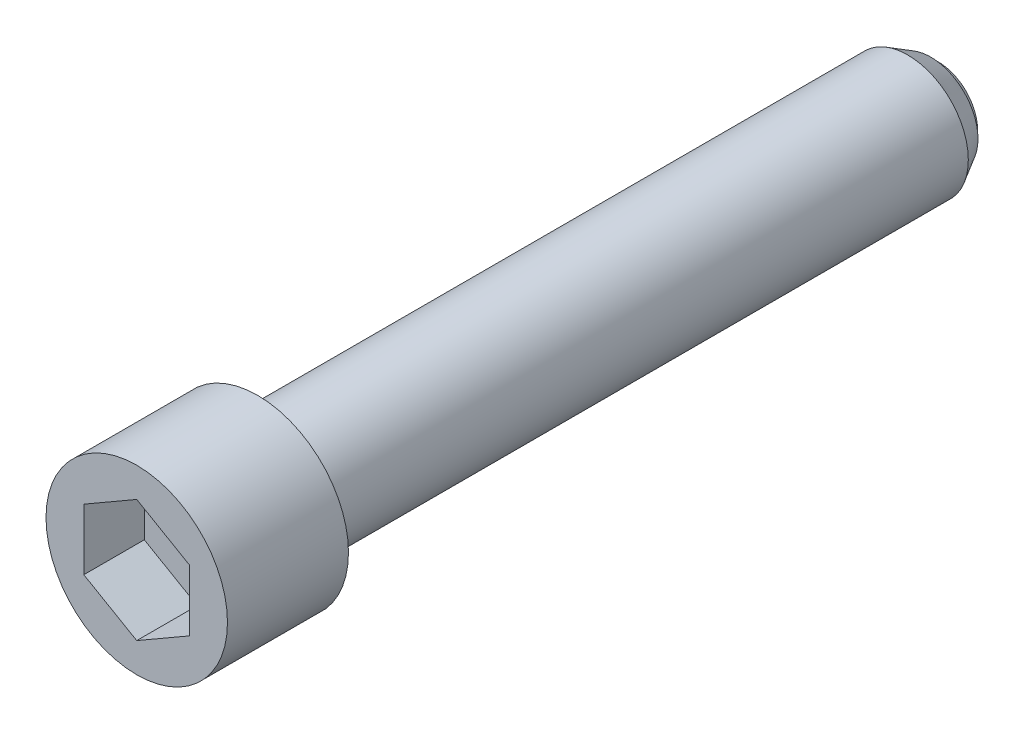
ISO-10303-21;
HEADER;
FILE_DESCRIPTION(('STEP AP214'),'2;1');
FILE_NAME('part.step','',(''),(''),'','','');
FILE_SCHEMA(('AUTOMOTIVE_DESIGN { 1 0 10303 214 1 1 1 1 }'));
ENDSEC;
DATA;
#1=APPLICATION_CONTEXT('core data for automotive mechanical design processes');
#2=APPLICATION_PROTOCOL_DEFINITION('international standard','automotive_design',2000,#1);
#3=PRODUCT_CONTEXT('',#1,'mechanical');
#4=PRODUCT('Part','Part','',(#3));
#5=PRODUCT_RELATED_PRODUCT_CATEGORY('part','',(#4));
#6=PRODUCT_DEFINITION_FORMATION('','',#4);
#7=PRODUCT_DEFINITION_CONTEXT('part definition',#1,'design');
#8=PRODUCT_DEFINITION('design','',#6,#7);
#9=PRODUCT_DEFINITION_SHAPE('','',#8);
#10=(LENGTH_UNIT() NAMED_UNIT(*) SI_UNIT(.MILLI.,.METRE.));
#11=(NAMED_UNIT(*) PLANE_ANGLE_UNIT() SI_UNIT($,.RADIAN.));
#12=(NAMED_UNIT(*) SI_UNIT($,.STERADIAN.) SOLID_ANGLE_UNIT());
#13=UNCERTAINTY_MEASURE_WITH_UNIT(LENGTH_MEASURE(1.E-05),#10,'distance_accuracy_value','');
#14=(GEOMETRIC_REPRESENTATION_CONTEXT(3) GLOBAL_UNCERTAINTY_ASSIGNED_CONTEXT((#13)) GLOBAL_UNIT_ASSIGNED_CONTEXT((#10,
#11,#12)) REPRESENTATION_CONTEXT('',''));
#15=CARTESIAN_POINT('',(0.,0.,0.));
#16=DIRECTION('',(0.,0.,1.));
#17=DIRECTION('',(1.,0.,0.));
#18=AXIS2_PLACEMENT_3D('',#15,#16,#17);
#19=CARTESIAN_POINT('',(0.,0.,3.));
#20=DIRECTION('',(0.,0.,-1.));
#21=DIRECTION('',(1.,0.,0.));
#22=AXIS2_PLACEMENT_3D('',#19,#20,#21);
#23=SPHERICAL_SURFACE('',#22,6.);
#24=CARTESIAN_POINT('',(0.,0.,1.));
#25=DIRECTION('',(0.,0.,-1.));
#26=DIRECTION('',(1.,0.,0.));
#27=AXIS2_PLACEMENT_3D('',#24,#25,#26);
#28=CIRCLE('',#27,5.65685424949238);
#29=CARTESIAN_POINT('',(5.65685424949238,0.,1.));
#30=VERTEX_POINT('',#29);
#31=EDGE_CURVE('E9',#30,#30,#28,.T.);
#32=CARTESIAN_POINT('',(0.,0.,0.));
#33=DIRECTION('',(0.,0.,-1.));
#34=DIRECTION('',(1.,0.,0.));
#35=AXIS2_PLACEMENT_3D('',#32,#33,#34);
#36=CIRCLE('',#35,5.19615242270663);
#37=CARTESIAN_POINT('',(5.19615242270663,0.,0.));
#38=VERTEX_POINT('',#37);
#39=EDGE_CURVE('E17',#38,#38,#36,.F.);
#40=CARTESIAN_POINT('',(5.65685424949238,0.,1.));
#41=CARTESIAN_POINT('',(5.65302587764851,0.,0.989171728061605));
#42=CARTESIAN_POINT('',(5.64916641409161,0.,0.978354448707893));
#43=CARTESIAN_POINT('',(5.64138543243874,0.,0.956742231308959));
#44=CARTESIAN_POINT('',(5.63746391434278,0.,0.945947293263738));
#45=CARTESIAN_POINT('',(5.62955895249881,0.,0.924380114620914));
#46=CARTESIAN_POINT('',(5.62557550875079,0.,0.913607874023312));
#47=CARTESIAN_POINT('',(5.61754682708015,0.,0.892086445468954));
#48=CARTESIAN_POINT('',(5.61350158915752,0.,0.881337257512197));
#49=CARTESIAN_POINT('',(5.60534945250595,0.,0.859862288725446));
#50=CARTESIAN_POINT('',(5.60124255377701,0.,0.849136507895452));
#51=CARTESIAN_POINT('',(5.59296723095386,0.,0.827708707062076));
#52=CARTESIAN_POINT('',(5.58879880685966,0.,0.817006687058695));
#53=CARTESIAN_POINT('',(5.58040057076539,0.,0.795626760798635));
#54=CARTESIAN_POINT('',(5.57617075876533,0.,0.784948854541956));
#55=CARTESIAN_POINT('',(5.56764988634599,0.,0.763617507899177));
#56=CARTESIAN_POINT('',(5.56335882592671,0.,0.752964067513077));
#57=CARTESIAN_POINT('',(5.55471559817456,0.,0.731682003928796));
#58=CARTESIAN_POINT('',(5.55036343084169,0.,0.721053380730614));
#59=CARTESIAN_POINT('',(5.54159813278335,0.,0.699821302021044));
#60=CARTESIAN_POINT('',(5.53718500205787,0.,0.689217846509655));
#61=CARTESIAN_POINT('',(5.52829792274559,0.,0.668036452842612));
#62=CARTESIAN_POINT('',(5.52382397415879,0.,0.657458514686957));
#63=CARTESIAN_POINT('',(5.51481540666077,0.,0.636328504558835));
#64=CARTESIAN_POINT('',(5.51028078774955,0.,0.625776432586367));
#65=CARTESIAN_POINT('',(5.50115102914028,0.,0.604698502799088));
#66=CARTESIAN_POINT('',(5.49655588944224,0.,0.594172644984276));
#67=CARTESIAN_POINT('',(5.48730524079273,0.,0.573147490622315));
#68=CARTESIAN_POINT('',(5.48264973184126,0.,0.562648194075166));
#69=CARTESIAN_POINT('',(5.47327849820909,0.,0.541676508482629));
#70=CARTESIAN_POINT('',(5.46856277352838,0.,0.531204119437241));
#71=CARTESIAN_POINT('',(5.45907126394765,0.,0.510286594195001));
#72=CARTESIAN_POINT('',(5.45429547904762,0.,0.499841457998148));
#73=CARTESIAN_POINT('',(5.44468400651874,0.,0.478978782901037));
#74=CARTESIAN_POINT('',(5.43984831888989,0.,0.468561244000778));
#75=CARTESIAN_POINT('',(5.43011720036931,0.,0.447754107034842));
#76=CARTESIAN_POINT('',(5.42522176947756,0.,0.437364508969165));
#77=CARTESIAN_POINT('',(5.41537132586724,0.,0.416613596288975));
#78=CARTESIAN_POINT('',(5.41041631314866,0.,0.406252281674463));
#79=CARTESIAN_POINT('',(5.40044686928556,0.,0.385558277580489));
#80=CARTESIAN_POINT('',(5.39543243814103,0.,0.375225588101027));
#81=CARTESIAN_POINT('',(5.38534432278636,0.,0.354589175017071));
#82=CARTESIAN_POINT('',(5.3802706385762,0.,0.344285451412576));
#83=CARTESIAN_POINT('',(5.37006418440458,0.,0.323707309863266));
#84=CARTESIAN_POINT('',(5.3649314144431,0.,0.313432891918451));
#85=CARTESIAN_POINT('',(5.35460695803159,0.,0.292913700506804));
#86=CARTESIAN_POINT('',(5.34941527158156,0.,0.282668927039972));
#87=CARTESIAN_POINT('',(5.33897315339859,0.,0.262209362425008));
#88=CARTESIAN_POINT('',(5.33372272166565,0.,0.251994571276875));
#89=CARTESIAN_POINT('',(5.32316328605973,0.,0.231595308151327));
#90=CARTESIAN_POINT('',(5.31785428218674,0.,0.221410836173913));
#91=CARTESIAN_POINT('',(5.30717787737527,0.,0.201072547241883));
#92=CARTESIAN_POINT('',(5.30181047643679,0.,0.190918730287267));
#93=CARTESIAN_POINT('',(5.29101745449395,0.,0.170642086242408));
#94=CARTESIAN_POINT('',(5.28559183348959,0.,0.160519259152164));
#95=CARTESIAN_POINT('',(5.27468255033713,0.,0.140304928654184));
#96=CARTESIAN_POINT('',(5.26919888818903,0.,0.130213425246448));
#97=CARTESIAN_POINT('',(5.25817370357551,0.,0.110062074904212));
#98=CARTESIAN_POINT('',(5.25263218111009,0.,0.100002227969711));
#99=CARTESIAN_POINT('',(5.24149145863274,0.,0.0799145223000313));
#100=CARTESIAN_POINT('',(5.23589225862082,0.,0.0698866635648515));
#101=CARTESIAN_POINT('',(5.22463636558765,0.,0.0498632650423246));
#102=CARTESIAN_POINT('',(5.2189796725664,0.,0.0398677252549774));
#103=CARTESIAN_POINT('',(5.20760898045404,0.,0.019909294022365));
#104=CARTESIAN_POINT('',(5.20189498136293,0.,0.0099464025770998));
#105=CARTESIAN_POINT('',(5.19615242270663,0.,0.));
#106=B_SPLINE_CURVE_WITH_KNOTS('',3,(#40,#41,#42,#43,#44,#45,#46,#47,#48,#49,#50,#51,#52,#53,
#54,#55,#56,#57,#58,#59,#60,#61,#62,#63,#64,#65,#66,#67,#68,#69,#70,#71,#72,#73,#74,#75,#76,#77,
#78,#79,#80,#81,#82,#83,#84,#85,#86,#87,#88,#89,#90,#91,#92,#93,#94,#95,#96,#97,#98,#99,#100,
#101,#102,#103,#104,#105),.UNSPECIFIED.,.F.,.F.,(4,2,2,2,2,2,2,2,2,2,2,2,2,2,2,2,2,2,2,2,2,2,2,
2,2,2,2,2,2,2,2,2,4),(0.,0.0344553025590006,0.0689106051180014,0.103365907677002,
0.137821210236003,0.172276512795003,0.206731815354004,0.241187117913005,0.275642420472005,
0.310097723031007,0.344553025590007,0.379008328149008,0.413463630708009,0.44791893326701,
0.48237423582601,0.516829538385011,0.551284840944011,0.585740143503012,0.620195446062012,
0.654650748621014,0.689106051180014,0.723561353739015,0.758016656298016,0.792471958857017,
0.826927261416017,0.861382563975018,0.895837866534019,0.930293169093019,0.96474847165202,
0.99920377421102,1.03365907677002,1.06811437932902,1.10256968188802),.UNSPECIFIED.);
#107=EDGE_CURVE('BSEAM14',#30,#38,#106,.T.);
#108=ORIENTED_EDGE('',*,*,#31,.T.);
#109=ORIENTED_EDGE('',*,*,#39,.T.);
#110=ORIENTED_EDGE('',*,*,#107,.T.);
#111=ORIENTED_EDGE('',*,*,#107,.F.);
#112=EDGE_LOOP('',(#108,#110,#109,#111));
#113=FACE_BOUND('',#112,.T.);
#114=ADVANCED_FACE('F14',(#113),#23,.T.);
#115=CARTESIAN_POINT('',(6.25,0.,1.));
#116=DIRECTION('',(0.,0.,1.));
#117=DIRECTION('',(-1.,0.,0.));
#118=AXIS2_PLACEMENT_3D('',#115,#116,#117);
#119=PLANE('',#118);
#120=ORIENTED_EDGE('',*,*,#31,.F.);
#121=EDGE_LOOP('',(#120));
#122=FACE_BOUND('',#121,.T.);
#123=CARTESIAN_POINT('',(0.,0.,1.));
#124=DIRECTION('',(0.,0.,-1.));
#125=DIRECTION('',(1.,0.,0.));
#126=AXIS2_PLACEMENT_3D('',#123,#124,#125);
#127=CIRCLE('',#126,6.25);
#128=CARTESIAN_POINT('',(6.25,0.,1.));
#129=VERTEX_POINT('',#128);
#130=EDGE_CURVE('E22',#129,#129,#127,.T.);
#131=ORIENTED_EDGE('',*,*,#130,.T.);
#132=EDGE_LOOP('',(#131));
#133=FACE_BOUND('',#132,.T.);
#134=ADVANCED_FACE('F137',(#122,#133),#119,.F.);
#135=CARTESIAN_POINT('',(0.,0.,1.));
#136=DIRECTION('',(0.,0.,1.));
#137=DIRECTION('',(-1.,0.,0.));
#138=AXIS2_PLACEMENT_3D('',#135,#136,#137);
#139=CONICAL_SURFACE('',#138,6.25,0.523598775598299);
#140=CARTESIAN_POINT('',(0.,0.,4.0310889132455));
#141=DIRECTION('',(0.,0.,-1.));
#142=DIRECTION('',(1.,0.,0.));
#143=AXIS2_PLACEMENT_3D('',#140,#141,#142);
#144=CIRCLE('',#143,8.);
#145=CARTESIAN_POINT('',(8.,0.,4.0310889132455));
#146=VERTEX_POINT('',#145);
#147=EDGE_CURVE('E131',#146,#146,#144,.T.);
#148=ORIENTED_EDGE('',*,*,#147,.T.);
#149=EDGE_LOOP('',(#148));
#150=FACE_BOUND('',#149,.T.);
#151=ORIENTED_EDGE('',*,*,#130,.F.);
#152=EDGE_LOOP('',(#151));
#153=FACE_BOUND('',#152,.T.);
#154=ADVANCED_FACE('F139',(#150,#153),#139,.T.);
#155=CARTESIAN_POINT('',(0.,0.,-20.));
#156=DIRECTION('',(0.,0.,-1.));
#157=DIRECTION('',(1.,0.,0.));
#158=AXIS2_PLACEMENT_3D('',#155,#156,#157);
#159=CYLINDRICAL_SURFACE('',#158,8.);
#160=CARTESIAN_POINT('',(0.,0.,90.));
#161=DIRECTION('',(0.,0.,-1.));
#162=DIRECTION('',(1.,0.,0.));
#163=AXIS2_PLACEMENT_3D('',#160,#161,#162);
#164=CIRCLE('',#163,8.);
#165=CARTESIAN_POINT('',(8.,0.,90.));
#166=VERTEX_POINT('',#165);
#167=EDGE_CURVE('E128',#166,#166,#164,.T.);
#168=ORIENTED_EDGE('',*,*,#167,.T.);
#169=EDGE_LOOP('',(#168));
#170=FACE_BOUND('',#169,.T.);
#171=ORIENTED_EDGE('',*,*,#147,.F.);
#172=EDGE_LOOP('',(#171));
#173=FACE_BOUND('',#172,.T.);
#174=ADVANCED_FACE('F141',(#170,#173),#159,.T.);
#175=CARTESIAN_POINT('',(8.,0.,90.));
#176=DIRECTION('',(0.,0.,-1.));
#177=DIRECTION('',(1.,0.,0.));
#178=AXIS2_PLACEMENT_3D('',#175,#176,#177);
#179=PLANE('',#178);
#180=CARTESIAN_POINT('',(0.,0.,90.));
#181=DIRECTION('',(0.,0.,-1.));
#182=DIRECTION('',(1.,0.,0.));
#183=AXIS2_PLACEMENT_3D('',#180,#181,#182);
#184=CIRCLE('',#183,12.);
#185=CARTESIAN_POINT('',(12.,0.,90.));
#186=VERTEX_POINT('',#185);
#187=EDGE_CURVE('E125',#186,#186,#184,.T.);
#188=ORIENTED_EDGE('',*,*,#187,.T.);
#189=EDGE_LOOP('',(#188));
#190=FACE_BOUND('',#189,.T.);
#191=ORIENTED_EDGE('',*,*,#167,.F.);
#192=EDGE_LOOP('',(#191));
#193=FACE_BOUND('',#192,.T.);
#194=ADVANCED_FACE('F149',(#190,#193),#179,.T.);
#195=CARTESIAN_POINT('',(0.,0.,-20.));
#196=DIRECTION('',(0.,0.,-1.));
#197=DIRECTION('',(1.,0.,0.));
#198=AXIS2_PLACEMENT_3D('',#195,#196,#197);
#199=CYLINDRICAL_SURFACE('',#198,12.);
#200=CARTESIAN_POINT('',(0.,0.,106.));
#201=DIRECTION('',(0.,0.,-1.));
#202=DIRECTION('',(1.,0.,0.));
#203=AXIS2_PLACEMENT_3D('',#200,#201,#202);
#204=CIRCLE('',#203,12.);
#205=CARTESIAN_POINT('',(12.,0.,106.));
#206=VERTEX_POINT('',#205);
#207=EDGE_CURVE('E122',#206,#206,#204,.T.);
#208=ORIENTED_EDGE('',*,*,#207,.T.);
#209=EDGE_LOOP('',(#208));
#210=FACE_BOUND('',#209,.T.);
#211=ORIENTED_EDGE('',*,*,#187,.F.);
#212=EDGE_LOOP('',(#211));
#213=FACE_BOUND('',#212,.T.);
#214=ADVANCED_FACE('F193',(#210,#213),#199,.T.);
#215=CARTESIAN_POINT('',(12.,0.,106.));
#216=DIRECTION('',(0.,0.,1.));
#217=DIRECTION('',(-1.,0.,0.));
#218=AXIS2_PLACEMENT_3D('',#215,#216,#217);
#219=PLANE('',#218);
#220=DIRECTION('',(-0.86602540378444,0.5,0.));
#221=VECTOR('',#220,1.);
#222=CARTESIAN_POINT('',(7.,4.04145188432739,106.));
#223=LINE('',#222,#221);
#224=CARTESIAN_POINT('',(7.,4.04145188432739,106.));
#225=VERTEX_POINT('',#224);
#226=CARTESIAN_POINT('',(0.,8.08290376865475,106.));
#227=VERTEX_POINT('',#226);
#228=EDGE_CURVE('E29',#225,#227,#223,.T.);
#229=ORIENTED_EDGE('',*,*,#228,.F.);
#230=DIRECTION('',(0.,1.,0.));
#231=VECTOR('',#230,1.);
#232=CARTESIAN_POINT('',(7.,-4.04145188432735,106.));
#233=LINE('',#232,#231);
#234=CARTESIAN_POINT('',(7.,-4.04145188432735,106.));
#235=VERTEX_POINT('',#234);
#236=EDGE_CURVE('E98',#235,#225,#233,.T.);
#237=ORIENTED_EDGE('',*,*,#236,.F.);
#238=DIRECTION('',(-0.866025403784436,-0.5,0.));
#239=VECTOR('',#238,1.);
#240=CARTESIAN_POINT('',(7.,-4.04145188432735,106.));
#241=LINE('',#240,#239);
#242=CARTESIAN_POINT('',(0.,-8.08290376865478,106.));
#243=VERTEX_POINT('',#242);
#244=EDGE_CURVE('E93',#235,#243,#241,.T.);
#245=ORIENTED_EDGE('',*,*,#244,.T.);
#246=DIRECTION('',(0.866025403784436,-0.5,0.));
#247=VECTOR('',#246,1.);
#248=CARTESIAN_POINT('',(-7.,-4.04145188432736,106.));
#249=LINE('',#248,#247);
#250=CARTESIAN_POINT('',(-7.,-4.04145188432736,106.));
#251=VERTEX_POINT('',#250);
#252=EDGE_CURVE('E91',#251,#243,#249,.T.);
#253=ORIENTED_EDGE('',*,*,#252,.F.);
#254=DIRECTION('',(0.,1.,0.));
#255=VECTOR('',#254,1.);
#256=CARTESIAN_POINT('',(-7.,-4.04145188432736,106.));
#257=LINE('',#256,#255);
#258=CARTESIAN_POINT('',(-7.,4.04145188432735,106.));
#259=VERTEX_POINT('',#258);
#260=EDGE_CURVE('E72',#251,#259,#257,.T.);
#261=ORIENTED_EDGE('',*,*,#260,.T.);
#262=DIRECTION('',(0.866025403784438,0.5,0.));
#263=VECTOR('',#262,1.);
#264=CARTESIAN_POINT('',(-7.,4.04145188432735,106.));
#265=LINE('',#264,#263);
#266=EDGE_CURVE('E83',#259,#227,#265,.T.);
#267=ORIENTED_EDGE('',*,*,#266,.T.);
#268=EDGE_LOOP('',(#229,#237,#245,#253,#261,#267));
#269=FACE_BOUND('',#268,.T.);
#270=ORIENTED_EDGE('',*,*,#207,.F.);
#271=EDGE_LOOP('',(#270));
#272=FACE_BOUND('',#271,.T.);
#273=ADVANCED_FACE('F87',(#269,#272),#219,.T.);
#274=CARTESIAN_POINT('',(7.,4.04145188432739,98.));
#275=DIRECTION('',(0.5,0.86602540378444,0.));
#276=DIRECTION('',(0.86602540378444,-0.5,0.));
#277=AXIS2_PLACEMENT_3D('',#274,#275,#276);
#278=PLANE('',#277);
#279=DIRECTION('',(0.,0.,1.));
#280=VECTOR('',#279,1.);
#281=CARTESIAN_POINT('',(7.,4.04145188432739,98.));
#282=LINE('',#281,#280);
#283=CARTESIAN_POINT('',(7.,4.04145188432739,98.));
#284=VERTEX_POINT('',#283);
#285=EDGE_CURVE('E36',#284,#225,#282,.T.);
#286=ORIENTED_EDGE('',*,*,#285,.T.);
#287=ORIENTED_EDGE('',*,*,#228,.T.);
#288=DIRECTION('',(0.,0.,1.));
#289=VECTOR('',#288,1.);
#290=CARTESIAN_POINT('',(0.,8.08290376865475,98.));
#291=LINE('',#290,#289);
#292=CARTESIAN_POINT('',(0.,8.08290376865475,98.));
#293=VERTEX_POINT('',#292);
#294=EDGE_CURVE('E80',#293,#227,#291,.T.);
#295=ORIENTED_EDGE('',*,*,#294,.F.);
#296=DIRECTION('',(-0.86602540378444,0.5,0.));
#297=VECTOR('',#296,1.);
#298=CARTESIAN_POINT('',(7.,4.04145188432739,98.));
#299=LINE('',#298,#297);
#300=EDGE_CURVE('E100',#284,#293,#299,.T.);
#301=ORIENTED_EDGE('',*,*,#300,.F.);
#302=EDGE_LOOP('',(#286,#287,#295,#301));
#303=FACE_BOUND('',#302,.T.);
#304=ADVANCED_FACE('F179',(#303),#278,.F.);
#305=CARTESIAN_POINT('',(7.,-4.04145188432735,98.));
#306=DIRECTION('',(1.,0.,0.));
#307=DIRECTION('',(0.,-1.,0.));
#308=AXIS2_PLACEMENT_3D('',#305,#306,#307);
#309=PLANE('',#308);
#310=DIRECTION('',(0.,0.,1.));
#311=VECTOR('',#310,1.);
#312=CARTESIAN_POINT('',(7.,-4.04145188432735,98.));
#313=LINE('',#312,#311);
#314=CARTESIAN_POINT('',(7.,-4.04145188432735,98.));
#315=VERTEX_POINT('',#314);
#316=EDGE_CURVE('E119',#315,#235,#313,.T.);
#317=ORIENTED_EDGE('',*,*,#316,.T.);
#318=ORIENTED_EDGE('',*,*,#236,.T.);
#319=ORIENTED_EDGE('',*,*,#285,.F.);
#320=DIRECTION('',(0.,1.,0.));
#321=VECTOR('',#320,1.);
#322=CARTESIAN_POINT('',(7.,-4.04145188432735,98.));
#323=LINE('',#322,#321);
#324=EDGE_CURVE('E112',#315,#284,#323,.T.);
#325=ORIENTED_EDGE('',*,*,#324,.F.);
#326=EDGE_LOOP('',(#317,#318,#319,#325));
#327=FACE_BOUND('',#326,.T.);
#328=ADVANCED_FACE('F187',(#327),#309,.F.);
#329=CARTESIAN_POINT('',(7.,-4.04145188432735,98.));
#330=DIRECTION('',(-0.5,0.866025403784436,0.));
#331=DIRECTION('',(0.866025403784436,0.5,0.));
#332=AXIS2_PLACEMENT_3D('',#329,#330,#331);
#333=PLANE('',#332);
#334=DIRECTION('',(0.,0.,1.));
#335=VECTOR('',#334,1.);
#336=CARTESIAN_POINT('',(0.,-8.08290376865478,98.));
#337=LINE('',#336,#335);
#338=CARTESIAN_POINT('',(0.,-8.08290376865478,98.));
#339=VERTEX_POINT('',#338);
#340=EDGE_CURVE('E117',#339,#243,#337,.T.);
#341=ORIENTED_EDGE('',*,*,#340,.T.);
#342=ORIENTED_EDGE('',*,*,#244,.F.);
#343=ORIENTED_EDGE('',*,*,#316,.F.);
#344=DIRECTION('',(-0.866025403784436,-0.5,0.));
#345=VECTOR('',#344,1.);
#346=CARTESIAN_POINT('',(7.,-4.04145188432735,98.));
#347=LINE('',#346,#345);
#348=EDGE_CURVE('E109',#315,#339,#347,.T.);
#349=ORIENTED_EDGE('',*,*,#348,.T.);
#350=EDGE_LOOP('',(#341,#342,#343,#349));
#351=FACE_BOUND('',#350,.T.);
#352=ADVANCED_FACE('F183',(#351),#333,.T.);
#353=CARTESIAN_POINT('',(-7.,-4.04145188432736,98.));
#354=DIRECTION('',(-0.5,-0.866025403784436,0.));
#355=DIRECTION('',(-0.866025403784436,0.5,0.));
#356=AXIS2_PLACEMENT_3D('',#353,#354,#355);
#357=PLANE('',#356);
#358=DIRECTION('',(0.,0.,1.));
#359=VECTOR('',#358,1.);
#360=CARTESIAN_POINT('',(-7.,-4.04145188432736,98.));
#361=LINE('',#360,#359);
#362=CARTESIAN_POINT('',(-7.,-4.04145188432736,98.));
#363=VERTEX_POINT('',#362);
#364=EDGE_CURVE('E79',#363,#251,#361,.T.);
#365=ORIENTED_EDGE('',*,*,#364,.T.);
#366=ORIENTED_EDGE('',*,*,#252,.T.);
#367=ORIENTED_EDGE('',*,*,#340,.F.);
#368=DIRECTION('',(0.866025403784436,-0.5,0.));
#369=VECTOR('',#368,1.);
#370=CARTESIAN_POINT('',(-7.,-4.04145188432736,98.));
#371=LINE('',#370,#369);
#372=EDGE_CURVE('E106',#363,#339,#371,.T.);
#373=ORIENTED_EDGE('',*,*,#372,.F.);
#374=EDGE_LOOP('',(#365,#366,#367,#373));
#375=FACE_BOUND('',#374,.T.);
#376=ADVANCED_FACE('F176',(#375),#357,.F.);
#377=CARTESIAN_POINT('',(-7.,-4.04145188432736,98.));
#378=DIRECTION('',(1.,0.,0.));
#379=DIRECTION('',(0.,-1.,0.));
#380=AXIS2_PLACEMENT_3D('',#377,#378,#379);
#381=PLANE('',#380);
#382=DIRECTION('',(0.,0.,1.));
#383=VECTOR('',#382,1.);
#384=CARTESIAN_POINT('',(-7.,4.04145188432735,98.));
#385=LINE('',#384,#383);
#386=CARTESIAN_POINT('',(-7.,4.04145188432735,98.));
#387=VERTEX_POINT('',#386);
#388=EDGE_CURVE('E68',#387,#259,#385,.T.);
#389=ORIENTED_EDGE('',*,*,#388,.T.);
#390=ORIENTED_EDGE('',*,*,#260,.F.);
#391=ORIENTED_EDGE('',*,*,#364,.F.);
#392=DIRECTION('',(0.,1.,0.));
#393=VECTOR('',#392,1.);
#394=CARTESIAN_POINT('',(-7.,-4.04145188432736,98.));
#395=LINE('',#394,#393);
#396=EDGE_CURVE('E75',#363,#387,#395,.T.);
#397=ORIENTED_EDGE('',*,*,#396,.T.);
#398=EDGE_LOOP('',(#389,#390,#391,#397));
#399=FACE_BOUND('',#398,.T.);
#400=ADVANCED_FACE('F70',(#399),#381,.T.);
#401=CARTESIAN_POINT('',(-7.,4.04145188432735,98.));
#402=DIRECTION('',(0.5,-0.866025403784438,0.));
#403=DIRECTION('',(-0.866025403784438,-0.5,0.));
#404=AXIS2_PLACEMENT_3D('',#401,#402,#403);
#405=PLANE('',#404);
#406=DIRECTION('',(0.866025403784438,0.5,0.));
#407=VECTOR('',#406,1.);
#408=CARTESIAN_POINT('',(-7.,4.04145188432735,98.));
#409=LINE('',#408,#407);
#410=EDGE_CURVE('E103',#387,#293,#409,.T.);
#411=ORIENTED_EDGE('',*,*,#410,.T.);
#412=ORIENTED_EDGE('',*,*,#294,.T.);
#413=ORIENTED_EDGE('',*,*,#266,.F.);
#414=ORIENTED_EDGE('',*,*,#388,.F.);
#415=EDGE_LOOP('',(#411,#412,#413,#414));
#416=FACE_BOUND('',#415,.T.);
#417=ADVANCED_FACE('F84',(#416),#405,.T.);
#418=CARTESIAN_POINT('',(14.,0.,98.));
#419=DIRECTION('',(0.,0.,1.));
#420=DIRECTION('',(-1.,0.,0.));
#421=AXIS2_PLACEMENT_3D('',#418,#419,#420);
#422=PLANE('',#421);
#423=ORIENTED_EDGE('',*,*,#300,.T.);
#424=ORIENTED_EDGE('',*,*,#410,.F.);
#425=ORIENTED_EDGE('',*,*,#396,.F.);
#426=ORIENTED_EDGE('',*,*,#372,.T.);
#427=ORIENTED_EDGE('',*,*,#348,.F.);
#428=ORIENTED_EDGE('',*,*,#324,.T.);
#429=EDGE_LOOP('',(#423,#424,#425,#426,#427,#428));
#430=FACE_BOUND('',#429,.T.);
#431=ADVANCED_FACE('F164',(#430),#422,.T.);
#432=CARTESIAN_POINT('',(0.,0.,0.));
#433=DIRECTION('',(0.,0.,-1.));
#434=DIRECTION('',(1.,0.,0.));
#435=AXIS2_PLACEMENT_3D('',#432,#433,#434);
#436=PLANE('',#435);
#437=ORIENTED_EDGE('',*,*,#39,.F.);
#438=EDGE_LOOP('',(#437));
#439=FACE_BOUND('',#438,.T.);
#440=ADVANCED_FACE('F162',(#439),#436,.T.);
#441=CLOSED_SHELL('',(#114,#134,#154,#174,#194,#214,#273,#304,#328,#352,#376,#400,#417,#431,#440));
#442=MANIFOLD_SOLID_BREP('B1',#441);
#443=ADVANCED_BREP_SHAPE_REPRESENTATION('',(#18,#442),#14);
#444=SHAPE_DEFINITION_REPRESENTATION(#9,#443);
ENDSEC;
END-ISO-10303-21;
